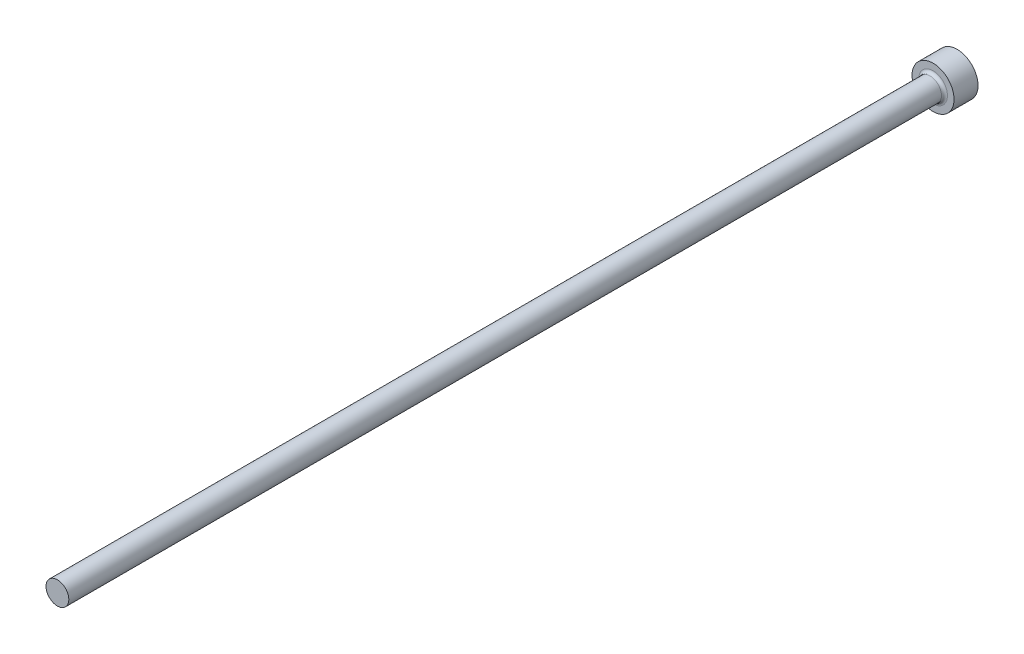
ISO-10303-21;
HEADER;
FILE_DESCRIPTION(('STEP AP214'),'2;1');
FILE_NAME('part.step','',(''),(''),'','','');
FILE_SCHEMA(('AUTOMOTIVE_DESIGN { 1 0 10303 214 1 1 1 1 }'));
ENDSEC;
DATA;
#1=APPLICATION_CONTEXT('core data for automotive mechanical design processes');
#2=APPLICATION_PROTOCOL_DEFINITION('international standard','automotive_design',2000,#1);
#3=PRODUCT_CONTEXT('',#1,'mechanical');
#4=PRODUCT('Part','Part','',(#3));
#5=PRODUCT_RELATED_PRODUCT_CATEGORY('part','',(#4));
#6=PRODUCT_DEFINITION_FORMATION('','',#4);
#7=PRODUCT_DEFINITION_CONTEXT('part definition',#1,'design');
#8=PRODUCT_DEFINITION('design','',#6,#7);
#9=PRODUCT_DEFINITION_SHAPE('','',#8);
#10=(LENGTH_UNIT() NAMED_UNIT(*) SI_UNIT(.MILLI.,.METRE.));
#11=(NAMED_UNIT(*) PLANE_ANGLE_UNIT() SI_UNIT($,.RADIAN.));
#12=(NAMED_UNIT(*) SI_UNIT($,.STERADIAN.) SOLID_ANGLE_UNIT());
#13=UNCERTAINTY_MEASURE_WITH_UNIT(LENGTH_MEASURE(1.E-05),#10,'distance_accuracy_value','');
#14=(GEOMETRIC_REPRESENTATION_CONTEXT(3) GLOBAL_UNCERTAINTY_ASSIGNED_CONTEXT((#13)) GLOBAL_UNIT_ASSIGNED_CONTEXT((#10,
#11,#12)) REPRESENTATION_CONTEXT('',''));
#15=CARTESIAN_POINT('',(0.,0.,0.));
#16=DIRECTION('',(0.,0.,1.));
#17=DIRECTION('',(1.,0.,0.));
#18=AXIS2_PLACEMENT_3D('',#15,#16,#17);
#19=CARTESIAN_POINT('',(3.5,0.,4.));
#20=DIRECTION('',(0.,0.,-1.));
#21=DIRECTION('',(-1.,0.,0.));
#22=AXIS2_PLACEMENT_3D('',#19,#20,#21);
#23=PLANE('',#22);
#24=CARTESIAN_POINT('',(0.,0.,4.));
#25=DIRECTION('',(0.,0.,-1.));
#26=DIRECTION('',(-1.,0.,0.));
#27=AXIS2_PLACEMENT_3D('',#24,#25,#26);
#28=CIRCLE('',#27,2.40000000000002);
#29=CARTESIAN_POINT('',(-2.40000000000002,0.,4.));
#30=VERTEX_POINT('',#29);
#31=EDGE_CURVE('E40',#30,#30,#28,.T.);
#32=ORIENTED_EDGE('',*,*,#31,.T.);
#33=EDGE_LOOP('',(#32));
#34=FACE_BOUND('',#33,.T.);
#35=CARTESIAN_POINT('',(0.,0.,4.));
#36=DIRECTION('',(0.,0.,-1.));
#37=DIRECTION('',(-1.,0.,0.));
#38=AXIS2_PLACEMENT_3D('',#35,#36,#37);
#39=CIRCLE('',#38,3.5);
#40=CARTESIAN_POINT('',(-3.5,0.,4.));
#41=VERTEX_POINT('',#40);
#42=EDGE_CURVE('E44',#41,#41,#39,.T.);
#43=ORIENTED_EDGE('',*,*,#42,.F.);
#44=EDGE_LOOP('',(#43));
#45=FACE_BOUND('',#44,.T.);
#46=ADVANCED_FACE('F33',(#34,#45),#23,.F.);
#47=CARTESIAN_POINT('',(0.,0.,-9.03322817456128));
#48=DIRECTION('',(0.,0.,-1.));
#49=DIRECTION('',(-1.,0.,0.));
#50=AXIS2_PLACEMENT_3D('',#47,#48,#49);
#51=CYLINDRICAL_SURFACE('',#50,3.5);
#52=CARTESIAN_POINT('',(0.,0.,0.));
#53=DIRECTION('',(0.,0.,-1.));
#54=DIRECTION('',(-1.,0.,0.));
#55=AXIS2_PLACEMENT_3D('',#52,#53,#54);
#56=CIRCLE('',#55,3.5);
#57=CARTESIAN_POINT('',(-3.5,0.,0.));
#58=VERTEX_POINT('',#57);
#59=EDGE_CURVE('E48',#58,#58,#56,.T.);
#60=ORIENTED_EDGE('',*,*,#59,.F.);
#61=EDGE_LOOP('',(#60));
#62=FACE_BOUND('',#61,.T.);
#63=ORIENTED_EDGE('',*,*,#42,.T.);
#64=EDGE_LOOP('',(#63));
#65=FACE_BOUND('',#64,.T.);
#66=ADVANCED_FACE('F68',(#62,#65),#51,.T.);
#67=CARTESIAN_POINT('',(0.,0.,0.));
#68=DIRECTION('',(0.,0.,1.));
#69=DIRECTION('',(1.,0.,0.));
#70=AXIS2_PLACEMENT_3D('',#67,#68,#69);
#71=PLANE('',#70);
#72=ORIENTED_EDGE('',*,*,#59,.T.);
#73=EDGE_LOOP('',(#72));
#74=FACE_BOUND('',#73,.T.);
#75=ADVANCED_FACE('F61',(#74),#71,.F.);
#76=CARTESIAN_POINT('',(0.,0.,150.));
#77=DIRECTION('',(0.,0.,-1.));
#78=DIRECTION('',(-1.,0.,0.));
#79=AXIS2_PLACEMENT_3D('',#76,#77,#78);
#80=PLANE('',#79);
#81=CARTESIAN_POINT('',(0.,0.,150.));
#82=DIRECTION('',(0.,0.,-1.));
#83=DIRECTION('',(-1.,0.,0.));
#84=AXIS2_PLACEMENT_3D('',#81,#82,#83);
#85=CIRCLE('',#84,1.90000000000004);
#86=CARTESIAN_POINT('',(-1.90000000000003,0.,150.));
#87=VERTEX_POINT('',#86);
#88=EDGE_CURVE('E53',#87,#87,#85,.T.);
#89=ORIENTED_EDGE('',*,*,#88,.F.);
#90=EDGE_LOOP('',(#89));
#91=FACE_BOUND('',#90,.T.);
#92=ADVANCED_FACE('F59',(#91),#80,.F.);
#93=CARTESIAN_POINT('',(0.,0.,-9.03322817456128));
#94=DIRECTION('',(0.,0.,-1.));
#95=DIRECTION('',(-1.,0.,0.));
#96=AXIS2_PLACEMENT_3D('',#93,#94,#95);
#97=CYLINDRICAL_SURFACE('',#96,1.90000000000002);
#98=CARTESIAN_POINT('',(0.,0.,4.5));
#99=DIRECTION('',(0.,0.,-1.));
#100=DIRECTION('',(-1.,0.,0.));
#101=AXIS2_PLACEMENT_3D('',#98,#99,#100);
#102=CIRCLE('',#101,1.90000000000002);
#103=CARTESIAN_POINT('',(-1.90000000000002,0.,4.5));
#104=VERTEX_POINT('',#103);
#105=EDGE_CURVE('E10',#104,#104,#102,.F.);
#106=ORIENTED_EDGE('',*,*,#105,.T.);
#107=EDGE_LOOP('',(#106));
#108=FACE_BOUND('',#107,.T.);
#109=ORIENTED_EDGE('',*,*,#88,.T.);
#110=EDGE_LOOP('',(#109));
#111=FACE_BOUND('',#110,.T.);
#112=ADVANCED_FACE('F57',(#108,#111),#97,.T.);
#113=CARTESIAN_POINT('',(0.,0.,4.5));
#114=DIRECTION('',(0.,0.,-1.));
#115=DIRECTION('',(-1.,0.,0.));
#116=AXIS2_PLACEMENT_3D('',#113,#114,#115);
#117=TOROIDAL_SURFACE('',#116,2.40000000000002,0.5);
#118=ORIENTED_EDGE('',*,*,#105,.F.);
#119=EDGE_LOOP('',(#118));
#120=FACE_BOUND('',#119,.T.);
#121=ORIENTED_EDGE('',*,*,#31,.F.);
#122=EDGE_LOOP('',(#121));
#123=FACE_BOUND('',#122,.T.);
#124=ADVANCED_FACE('F35',(#120,#123),#117,.F.);
#125=CLOSED_SHELL('',(#46,#66,#75,#92,#112,#124));
#126=MANIFOLD_SOLID_BREP('B2',#125);
#127=ADVANCED_BREP_SHAPE_REPRESENTATION('',(#18,#126),#14);
#128=SHAPE_DEFINITION_REPRESENTATION(#9,#127);
ENDSEC;
END-ISO-10303-21;
